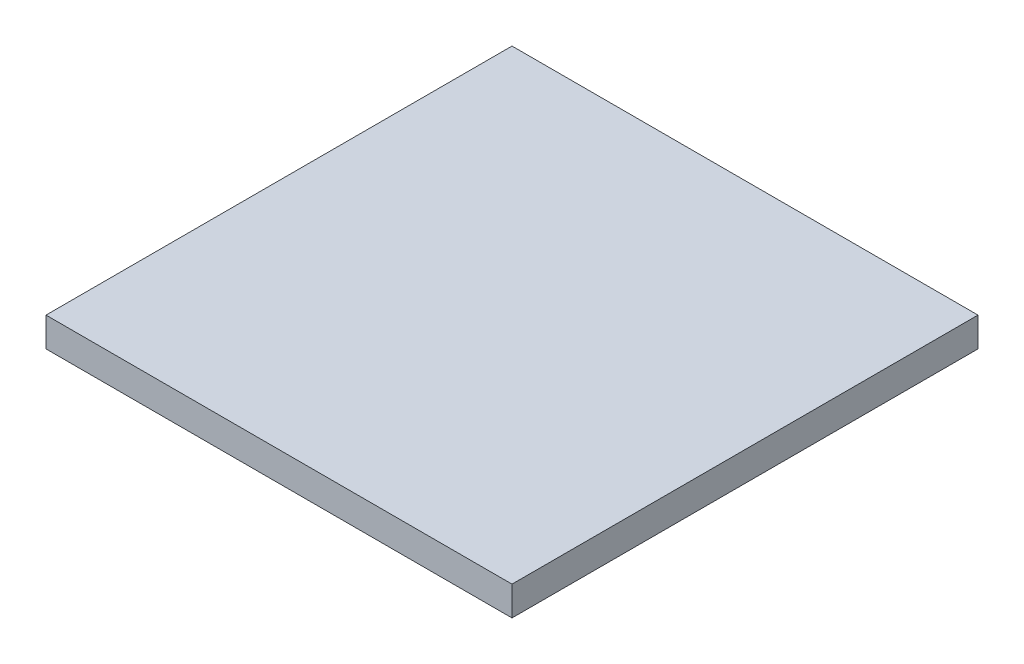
ISO-10303-21;
HEADER;
FILE_DESCRIPTION(('STEP AP214'),'2;1');
FILE_NAME('part.step','',(''),(''),'','','');
FILE_SCHEMA(('AUTOMOTIVE_DESIGN { 1 0 10303 214 1 1 1 1 }'));
ENDSEC;
DATA;
#1=APPLICATION_CONTEXT('core data for automotive mechanical design processes');
#2=APPLICATION_PROTOCOL_DEFINITION('international standard','automotive_design',2000,#1);
#3=PRODUCT_CONTEXT('',#1,'mechanical');
#4=PRODUCT('Part','Part','',(#3));
#5=PRODUCT_RELATED_PRODUCT_CATEGORY('part','',(#4));
#6=PRODUCT_DEFINITION_FORMATION('','',#4);
#7=PRODUCT_DEFINITION_CONTEXT('part definition',#1,'design');
#8=PRODUCT_DEFINITION('design','',#6,#7);
#9=PRODUCT_DEFINITION_SHAPE('','',#8);
#10=(LENGTH_UNIT() NAMED_UNIT(*) SI_UNIT(.MILLI.,.METRE.));
#11=(NAMED_UNIT(*) PLANE_ANGLE_UNIT() SI_UNIT($,.RADIAN.));
#12=(NAMED_UNIT(*) SI_UNIT($,.STERADIAN.) SOLID_ANGLE_UNIT());
#13=UNCERTAINTY_MEASURE_WITH_UNIT(LENGTH_MEASURE(1.E-05),#10,'distance_accuracy_value','');
#14=(GEOMETRIC_REPRESENTATION_CONTEXT(3) GLOBAL_UNCERTAINTY_ASSIGNED_CONTEXT((#13)) GLOBAL_UNIT_ASSIGNED_CONTEXT((#10,
#11,#12)) REPRESENTATION_CONTEXT('',''));
#15=CARTESIAN_POINT('',(0.,0.,0.));
#16=DIRECTION('',(0.,0.,1.));
#17=DIRECTION('',(1.,0.,0.));
#18=AXIS2_PLACEMENT_3D('',#15,#16,#17);
#19=CARTESIAN_POINT('',(-7.95,1.,7.95));
#20=DIRECTION('',(1.,0.,0.));
#21=DIRECTION('',(0.,0.,-1.));
#22=AXIS2_PLACEMENT_3D('',#19,#20,#21);
#23=PLANE('',#22);
#24=DIRECTION('',(0.,0.,1.));
#25=VECTOR('',#24,1.);
#26=CARTESIAN_POINT('',(-7.95,0.,7.95));
#27=LINE('',#26,#25);
#28=CARTESIAN_POINT('',(-7.95,0.,-7.95));
#29=VERTEX_POINT('',#28);
#30=CARTESIAN_POINT('',(-7.95,0.,7.95));
#31=VERTEX_POINT('',#30);
#32=EDGE_CURVE('E111',#29,#31,#27,.T.);
#33=ORIENTED_EDGE('',*,*,#32,.T.);
#34=DIRECTION('',(0.,-1.,0.));
#35=VECTOR('',#34,1.);
#36=CARTESIAN_POINT('',(-7.95,1.,7.95));
#37=LINE('',#36,#35);
#38=CARTESIAN_POINT('',(-7.95,1.,7.95));
#39=VERTEX_POINT('',#38);
#40=EDGE_CURVE('E11',#39,#31,#37,.T.);
#41=ORIENTED_EDGE('',*,*,#40,.F.);
#42=DIRECTION('',(0.,0.,1.));
#43=VECTOR('',#42,1.);
#44=CARTESIAN_POINT('',(-7.95,1.,7.95));
#45=LINE('',#44,#43);
#46=CARTESIAN_POINT('',(-7.95,1.,-7.95));
#47=VERTEX_POINT('',#46);
#48=EDGE_CURVE('E96',#47,#39,#45,.T.);
#49=ORIENTED_EDGE('',*,*,#48,.F.);
#50=DIRECTION('',(0.,-1.,0.));
#51=VECTOR('',#50,1.);
#52=CARTESIAN_POINT('',(-7.95,1.,-7.95));
#53=LINE('',#52,#51);
#54=EDGE_CURVE('E107',#47,#29,#53,.T.);
#55=ORIENTED_EDGE('',*,*,#54,.T.);
#56=EDGE_LOOP('',(#33,#41,#49,#55));
#57=FACE_BOUND('',#56,.T.);
#58=ADVANCED_FACE('F43',(#57),#23,.F.);
#59=CARTESIAN_POINT('',(7.95,1.,7.95));
#60=DIRECTION('',(0.,0.,-1.));
#61=DIRECTION('',(-1.,0.,0.));
#62=AXIS2_PLACEMENT_3D('',#59,#60,#61);
#63=PLANE('',#62);
#64=DIRECTION('',(1.,0.,0.));
#65=VECTOR('',#64,1.);
#66=CARTESIAN_POINT('',(7.95,0.,7.95));
#67=LINE('',#66,#65);
#68=CARTESIAN_POINT('',(7.95,0.,7.95));
#69=VERTEX_POINT('',#68);
#70=EDGE_CURVE('E100',#31,#69,#67,.T.);
#71=ORIENTED_EDGE('',*,*,#70,.T.);
#72=DIRECTION('',(0.,-1.,0.));
#73=VECTOR('',#72,1.);
#74=CARTESIAN_POINT('',(7.95,1.,7.95));
#75=LINE('',#74,#73);
#76=CARTESIAN_POINT('',(7.95,1.,7.95));
#77=VERTEX_POINT('',#76);
#78=EDGE_CURVE('E51',#77,#69,#75,.T.);
#79=ORIENTED_EDGE('',*,*,#78,.F.);
#80=DIRECTION('',(1.,0.,0.));
#81=VECTOR('',#80,1.);
#82=CARTESIAN_POINT('',(7.95,1.,7.95));
#83=LINE('',#82,#81);
#84=EDGE_CURVE('E91',#39,#77,#83,.T.);
#85=ORIENTED_EDGE('',*,*,#84,.F.);
#86=ORIENTED_EDGE('',*,*,#40,.T.);
#87=EDGE_LOOP('',(#71,#79,#85,#86));
#88=FACE_BOUND('',#87,.T.);
#89=ADVANCED_FACE('F99',(#88),#63,.F.);
#90=CARTESIAN_POINT('',(7.95,1.,7.95));
#91=DIRECTION('',(-1.,0.,0.));
#92=DIRECTION('',(0.,0.,1.));
#93=AXIS2_PLACEMENT_3D('',#90,#91,#92);
#94=PLANE('',#93);
#95=DIRECTION('',(0.,0.,-1.));
#96=VECTOR('',#95,1.);
#97=CARTESIAN_POINT('',(7.95,0.,7.95));
#98=LINE('',#97,#96);
#99=CARTESIAN_POINT('',(7.95,0.,-7.95));
#100=VERTEX_POINT('',#99);
#101=EDGE_CURVE('E78',#69,#100,#98,.T.);
#102=ORIENTED_EDGE('',*,*,#101,.T.);
#103=DIRECTION('',(0.,-1.,0.));
#104=VECTOR('',#103,1.);
#105=CARTESIAN_POINT('',(7.95,1.,-7.95));
#106=LINE('',#105,#104);
#107=CARTESIAN_POINT('',(7.95,1.,-7.95));
#108=VERTEX_POINT('',#107);
#109=EDGE_CURVE('E101',#108,#100,#106,.T.);
#110=ORIENTED_EDGE('',*,*,#109,.F.);
#111=DIRECTION('',(0.,0.,-1.));
#112=VECTOR('',#111,1.);
#113=CARTESIAN_POINT('',(7.95,1.,7.95));
#114=LINE('',#113,#112);
#115=EDGE_CURVE('E94',#77,#108,#114,.T.);
#116=ORIENTED_EDGE('',*,*,#115,.F.);
#117=ORIENTED_EDGE('',*,*,#78,.T.);
#118=EDGE_LOOP('',(#102,#110,#116,#117));
#119=FACE_BOUND('',#118,.T.);
#120=ADVANCED_FACE('F102',(#119),#94,.F.);
#121=CARTESIAN_POINT('',(7.95,1.,-7.95));
#122=DIRECTION('',(0.,0.,1.));
#123=DIRECTION('',(1.,0.,0.));
#124=AXIS2_PLACEMENT_3D('',#121,#122,#123);
#125=PLANE('',#124);
#126=DIRECTION('',(-1.,0.,0.));
#127=VECTOR('',#126,1.);
#128=CARTESIAN_POINT('',(7.95,0.,-7.95));
#129=LINE('',#128,#127);
#130=EDGE_CURVE('E84',#100,#29,#129,.T.);
#131=ORIENTED_EDGE('',*,*,#130,.T.);
#132=ORIENTED_EDGE('',*,*,#54,.F.);
#133=DIRECTION('',(-1.,0.,0.));
#134=VECTOR('',#133,1.);
#135=CARTESIAN_POINT('',(7.95,1.,-7.95));
#136=LINE('',#135,#134);
#137=EDGE_CURVE('E59',#108,#47,#136,.T.);
#138=ORIENTED_EDGE('',*,*,#137,.F.);
#139=ORIENTED_EDGE('',*,*,#109,.T.);
#140=EDGE_LOOP('',(#131,#132,#138,#139));
#141=FACE_BOUND('',#140,.T.);
#142=ADVANCED_FACE('F121',(#141),#125,.F.);
#143=CARTESIAN_POINT('',(0.,1.,0.));
#144=DIRECTION('',(0.,1.,0.));
#145=DIRECTION('',(0.,0.,1.));
#146=AXIS2_PLACEMENT_3D('',#143,#144,#145);
#147=PLANE('',#146);
#148=ORIENTED_EDGE('',*,*,#48,.T.);
#149=ORIENTED_EDGE('',*,*,#84,.T.);
#150=ORIENTED_EDGE('',*,*,#115,.T.);
#151=ORIENTED_EDGE('',*,*,#137,.T.);
#152=EDGE_LOOP('',(#148,#149,#150,#151));
#153=FACE_BOUND('',#152,.T.);
#154=ADVANCED_FACE('F92',(#153),#147,.T.);
#155=CARTESIAN_POINT('',(0.,0.,0.));
#156=DIRECTION('',(0.,1.,0.));
#157=DIRECTION('',(0.,0.,1.));
#158=AXIS2_PLACEMENT_3D('',#155,#156,#157);
#159=PLANE('',#158);
#160=ORIENTED_EDGE('',*,*,#32,.F.);
#161=ORIENTED_EDGE('',*,*,#130,.F.);
#162=ORIENTED_EDGE('',*,*,#101,.F.);
#163=ORIENTED_EDGE('',*,*,#70,.F.);
#164=EDGE_LOOP('',(#160,#161,#162,#163));
#165=FACE_BOUND('',#164,.T.);
#166=ADVANCED_FACE('F124',(#165),#159,.F.);
#167=CLOSED_SHELL('',(#58,#89,#120,#142,#154,#166));
#168=MANIFOLD_SOLID_BREP('B2',#167);
#169=ADVANCED_BREP_SHAPE_REPRESENTATION('',(#18,#168),#14);
#170=SHAPE_DEFINITION_REPRESENTATION(#9,#169);
ENDSEC;
END-ISO-10303-21;
